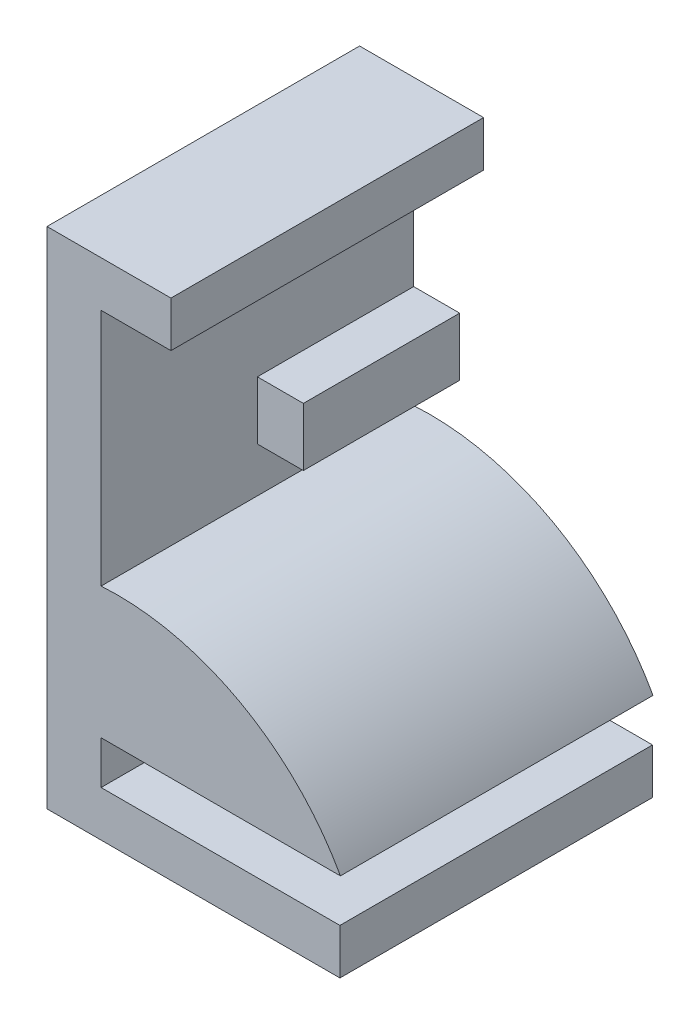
from build123d import *

# Parameters (mm, degrees)
EXTRUDE1_DEPTH     = 47.5
CUT_EXTRUDE1_REACH = 189.204
SKETCH3_W          = 13.972525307
SKETCH3_H          = 47.5


with BuildPart() as part:
    # Sketch1 → Extrude1 (new, symmetric)
    with BuildSketch(Plane(origin=(8.56426308, -28.387824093, 0), x_dir=(0, 1, 0), z_dir=(0, 0, 1))):
        with BuildLine():
            Line((-58.163386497, -54.421285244), (95.115473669, -54.421285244))
            Line((95.115473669, -54.421285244), (95.115473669, -92.090296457))
            Line((95.115473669, -92.090296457), (81.274577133, -92.090296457))
            Line((81.274577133, -92.090296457), (81.274577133, -70.863158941))
            Line((81.274577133, -70.863158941), (40.017487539, -70.863158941))
            Line((40.017487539, -70.863158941), (40.017487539, -84.835684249))
            Line((40.017487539, -84.835684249), (22.334466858, -84.835684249))
            Line((22.334466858, -84.835684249), (22.334466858, -70.863158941))
            Line((22.334466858, -70.863158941), (8.693279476, -70.863158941))
            ThreePointArc((8.693279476, -70.863158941), (-0.701981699, -113.021085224), (-31.219824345, -143.586146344))
            Line((-31.219824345, -143.586146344), (-31.219824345, -70.863158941))
            Line((-31.219824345, -70.863158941), (-44.32248996, -70.863158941))
            Line((-44.32248996, -70.863158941), (-44.32248996, -143.440294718))
            Line((-44.32248996, -143.440294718), (-58.163386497, -143.440294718))
            Line((-58.163386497, -143.440294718), (-58.163386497, -54.421285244))
        make_face()
    extrude(amount=EXTRUDE1_DEPTH, both=True)

    # Sketch3 → Cut-Extrude1 (cut, up to next)
    with BuildSketch(Plane(origin=(0, 11.629663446, 0), x_dir=(-1, 0, 0), z_dir=(0, 1, 0)), mode=Mode.PRIVATE) as cut_extrude1_sk1:
        with Locations((-86.413684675, 23.75)):
            Rectangle(SKETCH3_W, SKETCH3_H)
    cut_extrude1_tool1 = extrude(cut_extrude1_sk1.sketch, amount=-CUT_EXTRUDE1_REACH, mode=Mode.PRIVATE) & part.part
    add(cut_extrude1_tool1.solids().sort_by_distance((86.413685, 11.629663, 23.75))[0], mode=Mode.SUBTRACT)


solid = part.part
